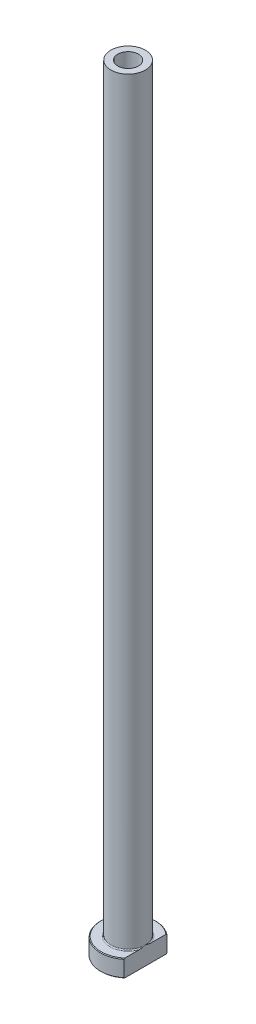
ISO-10303-21;
HEADER;
FILE_DESCRIPTION(('STEP AP214'),'2;1');
FILE_NAME('part.step','',(''),(''),'','','');
FILE_SCHEMA(('AUTOMOTIVE_DESIGN { 1 0 10303 214 1 1 1 1 }'));
ENDSEC;
DATA;
#1=APPLICATION_CONTEXT('core data for automotive mechanical design processes');
#2=APPLICATION_PROTOCOL_DEFINITION('international standard','automotive_design',2000,#1);
#3=PRODUCT_CONTEXT('',#1,'mechanical');
#4=PRODUCT('Part','Part','',(#3));
#5=PRODUCT_RELATED_PRODUCT_CATEGORY('part','',(#4));
#6=PRODUCT_DEFINITION_FORMATION('','',#4);
#7=PRODUCT_DEFINITION_CONTEXT('part definition',#1,'design');
#8=PRODUCT_DEFINITION('design','',#6,#7);
#9=PRODUCT_DEFINITION_SHAPE('','',#8);
#10=(LENGTH_UNIT() NAMED_UNIT(*) SI_UNIT(.MILLI.,.METRE.));
#11=(NAMED_UNIT(*) PLANE_ANGLE_UNIT() SI_UNIT($,.RADIAN.));
#12=(NAMED_UNIT(*) SI_UNIT($,.STERADIAN.) SOLID_ANGLE_UNIT());
#13=UNCERTAINTY_MEASURE_WITH_UNIT(LENGTH_MEASURE(1.E-05),#10,'distance_accuracy_value','');
#14=(GEOMETRIC_REPRESENTATION_CONTEXT(3) GLOBAL_UNCERTAINTY_ASSIGNED_CONTEXT((#13)) GLOBAL_UNIT_ASSIGNED_CONTEXT((#10,
#11,#12)) REPRESENTATION_CONTEXT('',''));
#15=CARTESIAN_POINT('',(0.,0.,0.));
#16=DIRECTION('',(0.,0.,1.));
#17=DIRECTION('',(1.,0.,0.));
#18=AXIS2_PLACEMENT_3D('',#15,#16,#17);
#19=CARTESIAN_POINT('',(0.,92.1876809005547,0.));
#20=DIRECTION('',(0.,1.,0.));
#21=DIRECTION('',(0.,0.,1.));
#22=AXIS2_PLACEMENT_3D('',#19,#20,#21);
#23=CYLINDRICAL_SURFACE('',#22,3.00000000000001);
#24=CARTESIAN_POINT('',(0.,225.,0.));
#25=DIRECTION('',(0.,1.,0.));
#26=DIRECTION('',(0.,0.,1.));
#27=AXIS2_PLACEMENT_3D('',#24,#25,#26);
#28=CIRCLE('',#27,3.00000000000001);
#29=CARTESIAN_POINT('',(0.,225.,3.00000000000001));
#30=VERTEX_POINT('',#29);
#31=EDGE_CURVE('E167',#30,#30,#28,.T.);
#32=ORIENTED_EDGE('',*,*,#31,.T.);
#33=EDGE_LOOP('',(#32));
#34=FACE_BOUND('',#33,.T.);
#35=CARTESIAN_POINT('',(0.,180.,0.));
#36=DIRECTION('',(0.,1.,0.));
#37=DIRECTION('',(0.,0.,1.));
#38=AXIS2_PLACEMENT_3D('',#35,#36,#37);
#39=CIRCLE('',#38,3.00000000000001);
#40=CARTESIAN_POINT('',(0.,180.,3.00000000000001));
#41=VERTEX_POINT('',#40);
#42=EDGE_CURVE('E170',#41,#41,#39,.T.);
#43=ORIENTED_EDGE('',*,*,#42,.F.);
#44=EDGE_LOOP('',(#43));
#45=FACE_BOUND('',#44,.T.);
#46=ADVANCED_FACE('F32',(#34,#45),#23,.F.);
#47=CARTESIAN_POINT('',(-3.00000000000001,225.,0.));
#48=DIRECTION('',(0.,1.,0.));
#49=DIRECTION('',(0.,0.,1.));
#50=AXIS2_PLACEMENT_3D('',#47,#48,#49);
#51=PLANE('',#50);
#52=CARTESIAN_POINT('',(0.,225.,0.));
#53=DIRECTION('',(0.,1.,0.));
#54=DIRECTION('',(0.,0.,1.));
#55=AXIS2_PLACEMENT_3D('',#52,#53,#54);
#56=CIRCLE('',#55,5.00000000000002);
#57=CARTESIAN_POINT('',(0.,225.,5.00000000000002));
#58=VERTEX_POINT('',#57);
#59=EDGE_CURVE('E174',#58,#58,#56,.T.);
#60=ORIENTED_EDGE('',*,*,#59,.T.);
#61=EDGE_LOOP('',(#60));
#62=FACE_BOUND('',#61,.T.);
#63=ORIENTED_EDGE('',*,*,#31,.F.);
#64=EDGE_LOOP('',(#63));
#65=FACE_BOUND('',#64,.T.);
#66=ADVANCED_FACE('F157',(#62,#65),#51,.T.);
#67=CARTESIAN_POINT('',(0.,92.1876809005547,0.));
#68=DIRECTION('',(0.,1.,0.));
#69=DIRECTION('',(0.,0.,1.));
#70=AXIS2_PLACEMENT_3D('',#67,#68,#69);
#71=CYLINDRICAL_SURFACE('',#70,5.);
#72=CARTESIAN_POINT('',(0.,5.3,0.));
#73=DIRECTION('',(0.,1.,0.));
#74=DIRECTION('',(0.,0.,1.));
#75=AXIS2_PLACEMENT_3D('',#72,#73,#74);
#76=CIRCLE('',#75,5.);
#77=CARTESIAN_POINT('',(5.,5.3,0.));
#78=VERTEX_POINT('',#77);
#79=EDGE_CURVE('E180',#78,#78,#76,.T.);
#80=ORIENTED_EDGE('',*,*,#79,.T.);
#81=EDGE_LOOP('',(#80));
#82=FACE_BOUND('',#81,.T.);
#83=ORIENTED_EDGE('',*,*,#59,.F.);
#84=EDGE_LOOP('',(#83));
#85=FACE_BOUND('',#84,.T.);
#86=ADVANCED_FACE('F162',(#82,#85),#71,.T.);
#87=CARTESIAN_POINT('',(-4.99999999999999,5.,0.));
#88=DIRECTION('',(0.,1.,0.));
#89=DIRECTION('',(0.,0.,1.));
#90=AXIS2_PLACEMENT_3D('',#87,#88,#89);
#91=PLANE('',#90);
#92=DIRECTION('',(0.,0.,1.));
#93=VECTOR('',#92,1.);
#94=CARTESIAN_POINT('',(5.,5.,0.));
#95=LINE('',#94,#93);
#96=CARTESIAN_POINT('',(5.,5.,-5.98665181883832));
#97=VERTEX_POINT('',#96);
#98=CARTESIAN_POINT('',(5.,5.,-1.75783958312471));
#99=VERTEX_POINT('',#98);
#100=EDGE_CURVE('E54',#97,#99,#95,.T.);
#101=ORIENTED_EDGE('',*,*,#100,.F.);
#102=CARTESIAN_POINT('',(0.,5.,0.));
#103=DIRECTION('',(0.,1.,0.));
#104=DIRECTION('',(0.,0.,1.));
#105=AXIS2_PLACEMENT_3D('',#102,#103,#104);
#106=CIRCLE('',#105,7.80000000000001);
#107=CARTESIAN_POINT('',(4.99999999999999,5.,5.98665181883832));
#108=VERTEX_POINT('',#107);
#109=EDGE_CURVE('E186',#97,#108,#106,.T.);
#110=ORIENTED_EDGE('',*,*,#109,.T.);
#111=CARTESIAN_POINT('',(5.,5.,1.75783958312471));
#112=VERTEX_POINT('',#111);
#113=EDGE_CURVE('E134',#112,#108,#95,.T.);
#114=ORIENTED_EDGE('',*,*,#113,.F.);
#115=CARTESIAN_POINT('',(0.,5.,0.));
#116=DIRECTION('',(0.,1.,0.));
#117=DIRECTION('',(0.,0.,1.));
#118=AXIS2_PLACEMENT_3D('',#115,#116,#117);
#119=CIRCLE('',#118,5.3);
#120=EDGE_CURVE('E183',#112,#99,#119,.F.);
#121=ORIENTED_EDGE('',*,*,#120,.T.);
#122=EDGE_LOOP('',(#101,#110,#114,#121));
#123=FACE_BOUND('',#122,.T.);
#124=ADVANCED_FACE('F197',(#123),#91,.T.);
#125=CARTESIAN_POINT('',(0.,92.1876809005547,0.));
#126=DIRECTION('',(0.,1.,0.));
#127=DIRECTION('',(0.,0.,1.));
#128=AXIS2_PLACEMENT_3D('',#125,#126,#127);
#129=CYLINDRICAL_SURFACE('',#128,7.99999999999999);
#130=DIRECTION('',(0.,-1.,0.));
#131=VECTOR('',#130,1.);
#132=CARTESIAN_POINT('',(4.99999999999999,225.,6.24499799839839));
#133=LINE('',#132,#131);
#134=CARTESIAN_POINT('',(4.99999999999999,4.80000000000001,6.24499799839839));
#135=VERTEX_POINT('',#134);
#136=CARTESIAN_POINT('',(4.99999999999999,0.199999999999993,6.24499799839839));
#137=VERTEX_POINT('',#136);
#138=EDGE_CURVE('E82',#135,#137,#133,.T.);
#139=ORIENTED_EDGE('',*,*,#138,.F.);
#140=CARTESIAN_POINT('',(0.,4.80000000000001,0.));
#141=DIRECTION('',(0.,1.,0.));
#142=DIRECTION('',(0.,0.,1.));
#143=AXIS2_PLACEMENT_3D('',#140,#141,#142);
#144=CIRCLE('',#143,7.99999999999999);
#145=CARTESIAN_POINT('',(5.,4.80000000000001,-6.24499799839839));
#146=VERTEX_POINT('',#145);
#147=EDGE_CURVE('E95',#135,#146,#144,.F.);
#148=ORIENTED_EDGE('',*,*,#147,.T.);
#149=DIRECTION('',(0.,-1.,0.));
#150=VECTOR('',#149,1.);
#151=CARTESIAN_POINT('',(5.,225.,-6.24499799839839));
#152=LINE('',#151,#150);
#153=CARTESIAN_POINT('',(5.,0.199999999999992,-6.24499799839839));
#154=VERTEX_POINT('',#153);
#155=EDGE_CURVE('E192',#146,#154,#152,.T.);
#156=ORIENTED_EDGE('',*,*,#155,.T.);
#157=CARTESIAN_POINT('',(0.,0.199999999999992,0.));
#158=DIRECTION('',(0.,-1.,0.));
#159=DIRECTION('',(0.,0.,-1.));
#160=AXIS2_PLACEMENT_3D('',#157,#158,#159);
#161=CIRCLE('',#160,7.99999999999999);
#162=EDGE_CURVE('E98',#154,#137,#161,.F.);
#163=ORIENTED_EDGE('',*,*,#162,.T.);
#164=EDGE_LOOP('',(#139,#148,#156,#163));
#165=FACE_BOUND('',#164,.T.);
#166=ADVANCED_FACE('F190',(#165),#129,.T.);
#167=CARTESIAN_POINT('',(-7.99999999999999,0.,0.));
#168=DIRECTION('',(0.,-1.,0.));
#169=DIRECTION('',(0.,0.,-1.));
#170=AXIS2_PLACEMENT_3D('',#167,#168,#169);
#171=PLANE('',#170);
#172=CARTESIAN_POINT('',(0.,0.,0.));
#173=DIRECTION('',(0.,-1.,0.));
#174=DIRECTION('',(0.,0.,-1.));
#175=AXIS2_PLACEMENT_3D('',#172,#173,#174);
#176=CIRCLE('',#175,3.75);
#177=CARTESIAN_POINT('',(0.,0.,-3.75));
#178=VERTEX_POINT('',#177);
#179=EDGE_CURVE('E40',#178,#178,#176,.F.);
#180=ORIENTED_EDGE('',*,*,#179,.T.);
#181=EDGE_LOOP('',(#180));
#182=FACE_BOUND('',#181,.T.);
#183=DIRECTION('',(0.,0.,-1.));
#184=VECTOR('',#183,1.);
#185=CARTESIAN_POINT('',(4.99999999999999,0.,6.24499799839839));
#186=LINE('',#185,#184);
#187=CARTESIAN_POINT('',(4.99999999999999,0.,5.98665181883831));
#188=VERTEX_POINT('',#187);
#189=CARTESIAN_POINT('',(5.,0.,-5.98665181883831));
#190=VERTEX_POINT('',#189);
#191=EDGE_CURVE('E47',#188,#190,#186,.T.);
#192=ORIENTED_EDGE('',*,*,#191,.F.);
#193=CARTESIAN_POINT('',(0.,0.,0.));
#194=DIRECTION('',(0.,-1.,0.));
#195=DIRECTION('',(0.,0.,-1.));
#196=AXIS2_PLACEMENT_3D('',#193,#194,#195);
#197=CIRCLE('',#196,7.8);
#198=EDGE_CURVE('E92',#188,#190,#197,.T.);
#199=ORIENTED_EDGE('',*,*,#198,.T.);
#200=EDGE_LOOP('',(#192,#199));
#201=FACE_BOUND('',#200,.T.);
#202=ADVANCED_FACE('F91',(#182,#201),#171,.T.);
#203=CARTESIAN_POINT('',(0.,92.1876809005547,0.));
#204=DIRECTION('',(0.,1.,0.));
#205=DIRECTION('',(0.,0.,1.));
#206=AXIS2_PLACEMENT_3D('',#203,#204,#205);
#207=CYLINDRICAL_SURFACE('',#206,3.25);
#208=CARTESIAN_POINT('',(0.,0.499999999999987,0.));
#209=DIRECTION('',(0.,-1.,0.));
#210=DIRECTION('',(0.,0.,-1.));
#211=AXIS2_PLACEMENT_3D('',#208,#209,#210);
#212=CIRCLE('',#211,3.25);
#213=CARTESIAN_POINT('',(0.,0.499999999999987,-3.25));
#214=VERTEX_POINT('',#213);
#215=EDGE_CURVE('E11',#214,#214,#212,.T.);
#216=ORIENTED_EDGE('',*,*,#215,.T.);
#217=EDGE_LOOP('',(#216));
#218=FACE_BOUND('',#217,.T.);
#219=CARTESIAN_POINT('',(0.,168.,0.));
#220=DIRECTION('',(0.,1.,0.));
#221=DIRECTION('',(0.,0.,1.));
#222=AXIS2_PLACEMENT_3D('',#219,#220,#221);
#223=CIRCLE('',#222,3.25000000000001);
#224=CARTESIAN_POINT('',(0.,168.,3.25000000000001));
#225=VERTEX_POINT('',#224);
#226=EDGE_CURVE('E172',#225,#225,#223,.T.);
#227=ORIENTED_EDGE('',*,*,#226,.T.);
#228=EDGE_LOOP('',(#227));
#229=FACE_BOUND('',#228,.T.);
#230=ADVANCED_FACE('F215',(#218,#229),#207,.F.);
#231=CARTESIAN_POINT('',(0.,168.,0.));
#232=DIRECTION('',(0.,-1.,0.));
#233=DIRECTION('',(0.,0.,-1.));
#234=AXIS2_PLACEMENT_3D('',#231,#232,#233);
#235=CONICAL_SURFACE('',#234,3.25000000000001,0.0208303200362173);
#236=ORIENTED_EDGE('',*,*,#42,.T.);
#237=EDGE_LOOP('',(#236));
#238=FACE_BOUND('',#237,.T.);
#239=ORIENTED_EDGE('',*,*,#226,.F.);
#240=EDGE_LOOP('',(#239));
#241=FACE_BOUND('',#240,.T.);
#242=ADVANCED_FACE('F111',(#238,#241),#235,.F.);
#243=CARTESIAN_POINT('',(0.,5.3,0.));
#244=DIRECTION('',(0.,1.,0.));
#245=DIRECTION('',(0.,0.,1.));
#246=AXIS2_PLACEMENT_3D('',#243,#244,#245);
#247=TOROIDAL_SURFACE('',#246,5.3,0.3);
#248=ORIENTED_EDGE('',*,*,#120,.F.);
#249=CARTESIAN_POINT('',(5.,5.3,0.));
#250=CARTESIAN_POINT('',(5.,5.30000062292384,-1.314694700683E-10));
#251=CARTESIAN_POINT('',(5.,5.30000124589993,2.52759345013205E-07));
#252=CARTESIAN_POINT('',(5.,5.30000240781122,9.47164604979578E-07));
#253=CARTESIAN_POINT('',(5.,5.30000293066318,1.40594067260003E-06));
#254=CARTESIAN_POINT('',(5.,5.30000402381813,2.50637647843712E-06));
#255=CARTESIAN_POINT('',(5.,5.30000457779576,3.16588958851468E-06));
#256=CARTESIAN_POINT('',(5.,5.30000556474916,4.52860022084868E-06));
#257=CARTESIAN_POINT('',(5.,5.30000600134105,5.22939500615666E-06));
#258=CARTESIAN_POINT('',(5.,5.30000763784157,7.96122073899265E-06));
#259=CARTESIAN_POINT('',(5.,5.30000875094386,1.00477420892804E-05));
#260=CARTESIAN_POINT('',(5.,5.30001056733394,1.41660886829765E-05));
#261=CARTESIAN_POINT('',(5.,5.30001129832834,1.61861795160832E-05));
#262=CARTESIAN_POINT('',(5.,5.30001439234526,2.47865760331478E-05));
#263=CARTESIAN_POINT('',(5.,5.30001672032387,3.13830310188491E-05));
#264=CARTESIAN_POINT('',(5.,5.30002012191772,4.38084251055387E-05));
#265=CARTESIAN_POINT('',(5.,5.30002133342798,4.95992766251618E-05));
#266=CARTESIAN_POINT('',(4.99999999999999,5.30003020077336,9.27862656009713E-05));
#267=CARTESIAN_POINT('',(4.99999999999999,5.30003696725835,0.000130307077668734));
#268=CARTESIAN_POINT('',(5.,5.30006659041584,0.000278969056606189));
#269=CARTESIAN_POINT('',(5.,5.30009481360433,0.000389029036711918));
#270=CARTESIAN_POINT('',(4.99999999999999,5.30020506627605,0.000826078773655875));
#271=CARTESIAN_POINT('',(4.99999999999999,5.30028365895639,0.00115365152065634));
#272=CARTESIAN_POINT('',(5.,5.30059919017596,0.00245925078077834));
#273=CARTESIAN_POINT('',(5.,5.30084048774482,0.00343651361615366));
#274=CARTESIAN_POINT('',(4.99999999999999,5.30184626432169,0.00752058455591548));
#275=CARTESIAN_POINT('',(4.99999999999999,5.30260525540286,0.0106283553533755));
#276=CARTESIAN_POINT('',(5.00000000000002,5.30996461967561,0.0407482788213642));
#277=CARTESIAN_POINT('',(5.,5.31658985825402,0.0677561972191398));
#278=CARTESIAN_POINT('',(4.99999999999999,5.32953319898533,0.120688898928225));
#279=CARTESIAN_POINT('',(4.99999999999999,5.3358528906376,0.146613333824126));
#280=CARTESIAN_POINT('',(5.,5.34926050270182,0.201795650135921));
#281=CARTESIAN_POINT('',(5.,5.35634306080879,0.231054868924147));
#282=CARTESIAN_POINT('',(4.99999999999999,5.37050252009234,0.289917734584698));
#283=CARTESIAN_POINT('',(5.,5.3775784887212,0.319521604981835));
#284=CARTESIAN_POINT('',(5.,5.39452602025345,0.391032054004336));
#285=CARTESIAN_POINT('',(5.,5.40434071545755,0.432952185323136));
#286=CARTESIAN_POINT('',(5.,5.42340141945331,0.515763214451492));
#287=CARTESIAN_POINT('',(5.,5.43265559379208,0.556652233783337));
#288=CARTESIAN_POINT('',(5.,5.4571055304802,0.667075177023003));
#289=CARTESIAN_POINT('',(5.,5.47194176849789,0.736689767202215));
#290=CARTESIAN_POINT('',(5.,5.50018229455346,0.876836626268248));
#291=CARTESIAN_POINT('',(5.,5.51357312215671,0.947371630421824));
#292=CARTESIAN_POINT('',(5.,5.53930921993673,1.09497328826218));
#293=CARTESIAN_POINT('',(5.,5.55146217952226,1.1720743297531));
#294=CARTESIAN_POINT('',(5.,5.5723966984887,1.32672649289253));
#295=CARTESIAN_POINT('',(5.,5.58117877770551,1.40427754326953));
#296=CARTESIAN_POINT('',(5.,5.59499725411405,1.5687382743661));
#297=CARTESIAN_POINT('',(5.,5.59948802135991,1.65570044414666));
#298=CARTESIAN_POINT('',(5.,5.60018885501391,1.78535304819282));
#299=CARTESIAN_POINT('',(5.,5.59945214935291,1.82802575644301));
#300=CARTESIAN_POINT('',(5.,5.5955936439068,1.91325081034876));
#301=CARTESIAN_POINT('',(5.,5.59247319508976,1.95580321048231));
#302=CARTESIAN_POINT('',(5.,5.58383242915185,2.03512365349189));
#303=CARTESIAN_POINT('',(5.,5.57867386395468,2.07192937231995));
#304=CARTESIAN_POINT('',(5.,5.56543793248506,2.14526756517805));
#305=CARTESIAN_POINT('',(5.,5.55734203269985,2.18179676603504));
#306=CARTESIAN_POINT('',(5.,5.5371800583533,2.25427226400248));
#307=CARTESIAN_POINT('',(5.,5.52507057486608,2.29020746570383));
#308=CARTESIAN_POINT('',(5.,5.50270928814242,2.34223029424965));
#309=CARTESIAN_POINT('',(5.,5.49457811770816,2.35922314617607));
#310=CARTESIAN_POINT('',(5.,5.47657809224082,2.39224900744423));
#311=CARTESIAN_POINT('',(5.,5.46671281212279,2.40828390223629));
#312=CARTESIAN_POINT('',(5.,5.4469589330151,2.43579467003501));
#313=CARTESIAN_POINT('',(5.,5.43745879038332,2.44754592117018));
#314=CARTESIAN_POINT('',(5.,5.41677914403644,2.46946476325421));
#315=CARTESIAN_POINT('',(5.,5.40560543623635,2.47963758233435));
#316=CARTESIAN_POINT('',(5.,5.38617750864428,2.49393642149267));
#317=CARTESIAN_POINT('',(5.,5.37851643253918,2.49886271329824));
#318=CARTESIAN_POINT('',(5.,5.36252740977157,2.50749953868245));
#319=CARTESIAN_POINT('',(5.,5.35419984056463,2.51121075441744));
#320=CARTESIAN_POINT('',(5.,5.33690648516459,2.51712941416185));
#321=CARTESIAN_POINT('',(5.,5.32793451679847,2.51931927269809));
#322=CARTESIAN_POINT('',(5.,5.30973576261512,2.52185978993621));
#323=CARTESIAN_POINT('',(5.,5.30050931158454,2.52221275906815));
#324=CARTESIAN_POINT('',(5.,5.28349166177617,2.52112455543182));
#325=CARTESIAN_POINT('',(5.,5.27568322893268,2.51993178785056));
#326=CARTESIAN_POINT('',(5.,5.26036860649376,2.51628294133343));
#327=CARTESIAN_POINT('',(5.,5.25286261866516,2.51382603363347));
#328=CARTESIAN_POINT('',(5.,5.23590266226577,2.50685484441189));
#329=CARTESIAN_POINT('',(5.,5.22661875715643,2.5019298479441));
#330=CARTESIAN_POINT('',(5.,5.20895514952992,2.490665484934));
#331=CARTESIAN_POINT('',(5.,5.20057756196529,2.48432291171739));
#332=CARTESIAN_POINT('',(5.,5.17987008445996,2.46645212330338));
#333=CARTESIAN_POINT('',(5.,5.16824151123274,2.45411867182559));
#334=CARTESIAN_POINT('',(5.,5.1469246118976,2.42790849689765));
#335=CARTESIAN_POINT('',(5.,5.13723987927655,2.41402898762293));
#336=CARTESIAN_POINT('',(5.,5.11080706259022,2.37143175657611));
#337=CARTESIAN_POINT('',(5.,5.0962877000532,2.34134703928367));
#338=CARTESIAN_POINT('',(5.,5.0713034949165,2.27940731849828));
#339=CARTESIAN_POINT('',(5.,5.06087110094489,2.24754035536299));
#340=CARTESIAN_POINT('',(5.,5.038903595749,2.1678724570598));
#341=CARTESIAN_POINT('',(5.,5.02913523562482,2.11959065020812));
#342=CARTESIAN_POINT('',(5.,5.01416953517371,2.02224928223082));
#343=CARTESIAN_POINT('',(5.,5.00898637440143,1.97318778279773));
#344=CARTESIAN_POINT('',(5.,5.0022082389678,1.8763576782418));
#345=CARTESIAN_POINT('',(5.,5.00050709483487,1.82859609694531));
#346=CARTESIAN_POINT('',(5.,4.99969104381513,1.73330165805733));
#347=CARTESIAN_POINT('',(5.,5.00056327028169,1.68576884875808));
#348=CARTESIAN_POINT('',(5.,5.00484296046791,1.57937770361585));
#349=CARTESIAN_POINT('',(5.,5.00880932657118,1.52054285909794));
#350=CARTESIAN_POINT('',(5.,5.01925964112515,1.40312974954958));
#351=CARTESIAN_POINT('',(5.,5.02574264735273,1.34455139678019));
#352=CARTESIAN_POINT('',(5.,5.040900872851,1.22627662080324));
#353=CARTESIAN_POINT('',(5.,5.04962425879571,1.16658647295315));
#354=CARTESIAN_POINT('',(5.,5.06877923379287,1.04732463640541));
#355=CARTESIAN_POINT('',(5.,5.07921523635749,0.987753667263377));
#356=CARTESIAN_POINT('',(5.,5.10551698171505,0.846936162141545));
#357=CARTESIAN_POINT('',(4.99999999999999,5.12196565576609,0.765799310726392));
#358=CARTESIAN_POINT('',(5.,5.15639716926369,0.604819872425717));
#359=CARTESIAN_POINT('',(5.,5.17436050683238,0.524973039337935));
#360=CARTESIAN_POINT('',(4.99999999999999,5.20921667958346,0.374726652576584));
#361=CARTESIAN_POINT('',(4.99999999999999,5.22599388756,0.304300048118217));
#362=CARTESIAN_POINT('',(5.,5.25191105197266,0.196907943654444));
#363=CARTESIAN_POINT('',(5.00000000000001,5.26090146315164,0.159905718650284));
#364=CARTESIAN_POINT('',(4.99999999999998,5.27881854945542,0.0865164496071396));
#365=CARTESIAN_POINT('',(4.99999999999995,5.2877439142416,0.0501291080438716));
#366=CARTESIAN_POINT('',(5.,5.29739627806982,0.0106218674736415));
#367=CARTESIAN_POINT('',(5.,5.29815688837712,0.00750762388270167));
#368=CARTESIAN_POINT('',(4.99999999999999,5.29916304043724,0.00342209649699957));
#369=CARTESIAN_POINT('',(4.99999999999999,5.29940309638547,0.00244985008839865));
#370=CARTESIAN_POINT('',(5.,5.29971711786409,0.00115049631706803));
#371=CARTESIAN_POINT('',(5.,5.29979541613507,0.00082414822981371));
#372=CARTESIAN_POINT('',(4.99999999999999,5.29990531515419,0.000388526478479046));
#373=CARTESIAN_POINT('',(4.99999999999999,5.2999334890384,0.000278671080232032));
#374=CARTESIAN_POINT('',(5.,5.29996306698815,0.00013024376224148));
#375=CARTESIAN_POINT('',(5.,5.29996982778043,9.27511422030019E-05));
#376=CARTESIAN_POINT('',(4.99999999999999,5.29997868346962,4.95929917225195E-05));
#377=CARTESIAN_POINT('',(4.99999999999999,5.29997989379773,4.38036586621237E-05));
#378=CARTESIAN_POINT('',(4.99999999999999,5.29998329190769,3.13814212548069E-05));
#379=CARTESIAN_POINT('',(4.99999999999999,5.29998561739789,2.47865239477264E-05));
#380=CARTESIAN_POINT('',(5.,5.29998870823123,1.61877558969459E-05));
#381=CARTESIAN_POINT('',(5.,5.29998943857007,1.41677782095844E-05));
#382=CARTESIAN_POINT('',(5.,5.29999125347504,1.00495542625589E-05));
#383=CARTESIAN_POINT('',(5.,5.29999236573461,7.96302750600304E-06));
#384=CARTESIAN_POINT('',(5.,5.29999400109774,5.23107472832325E-06));
#385=CARTESIAN_POINT('',(5.,5.29999443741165,4.53021092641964E-06));
#386=CARTESIAN_POINT('',(5.,5.2999954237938,3.16731207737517E-06));
#387=CARTESIAN_POINT('',(5.,5.29999597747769,2.50767769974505E-06));
#388=CARTESIAN_POINT('',(5.,5.29999707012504,1.40695909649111E-06));
#389=CARTESIAN_POINT('',(5.,5.29999759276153,9.48032716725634E-07));
#390=CARTESIAN_POINT('',(5.,5.29999875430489,2.53244456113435E-07));
#391=CARTESIAN_POINT('',(5.,5.29999937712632,1.31460272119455E-10));
#392=CARTESIAN_POINT('',(5.,5.3,0.));
#393=B_SPLINE_CURVE_WITH_KNOTS('',3,(#249,#250,#251,#252,#253,#254,#255,#256,#257,#258,#259,
#260,#261,#262,#263,#264,#265,#266,#267,#268,#269,#270,#271,#272,#273,#274,#275,#276,#277,#278,
#279,#280,#281,#282,#283,#284,#285,#286,#287,#288,#289,#290,#291,#292,#293,#294,#295,#296,#297,
#298,#299,#300,#301,#302,#303,#304,#305,#306,#307,#308,#309,#310,#311,#312,#313,#314,#315,#316,
#317,#318,#319,#320,#321,#322,#323,#324,#325,#326,#327,#328,#329,#330,#331,#332,#333,#334,#335,
#336,#337,#338,#339,#340,#341,#342,#343,#344,#345,#346,#347,#348,#349,#350,#351,#352,#353,#354,
#355,#356,#357,#358,#359,#360,#361,#362,#363,#364,#365,#366,#367,#368,#369,#370,#371,#372,#373,
#374,#375,#376,#377,#378,#379,#380,#381,#382,#383,#384,#385,#386,#387,#388,#389,#390,#391,#392),
.UNSPECIFIED.,.T.,.F.,(4,2,2,2,2,2,2,2,2,2,2,2,2,2,2,2,2,2,2,2,2,2,2,2,2,2,2,2,2,2,2,2,2,2,2,2,
2,2,2,2,2,2,2,2,2,2,2,2,2,2,2,2,2,2,2,2,2,2,2,2,2,2,2,2,2,2,2,2,2,2,2,4),(0.,
1.88939154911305E-06,3.98058628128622E-06,6.54818199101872E-06,9.0240392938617E-06,
1.60938698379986E-05,2.25328132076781E-05,4.34843859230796E-05,6.12120117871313E-05,
0.00017562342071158,0.000516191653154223,0.00152710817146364,0.00454656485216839,
0.0141443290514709,0.0975679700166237,0.177619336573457,0.267931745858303,0.359245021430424,
0.488405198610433,0.614173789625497,0.827694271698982,1.04305715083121,1.2771560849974,
1.51121890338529,1.77214751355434,1.9001350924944,2.02805018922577,2.13945459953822,
2.25157451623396,2.36494894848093,2.42139235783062,2.47772074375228,2.52293802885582,
2.56800219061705,2.59524342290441,2.62246933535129,2.65000494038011,2.67750590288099,
2.70108948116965,2.72468854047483,2.7560397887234,2.78746268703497,2.83802806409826,
2.8886860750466,2.98834295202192,3.0887757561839,3.23618650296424,3.38405153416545,
3.52733651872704,3.66990630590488,3.8467390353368,4.02350562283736,4.2044477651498,
4.38586374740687,4.63419556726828,4.87971270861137,5.09690175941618,5.21113882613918,
5.32353360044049,5.33315137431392,5.3361553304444,5.3371624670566,5.33750240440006,
5.33761672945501,5.337634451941,5.33765539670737,5.33766183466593,5.33766890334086,
5.3376713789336,5.3376739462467,5.33767603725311,5.33767792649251),.UNSPECIFIED.);
#394=EDGE_CURVE('E126',#112,#78,#393,.T.);
#395=ORIENTED_EDGE('',*,*,#394,.T.);
#396=ORIENTED_EDGE('',*,*,#79,.F.);
#397=CARTESIAN_POINT('',(5.,5.3,0.));
#398=CARTESIAN_POINT('',(5.,5.29999937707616,1.31471023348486E-10));
#399=CARTESIAN_POINT('',(5.,5.29999875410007,-2.52759343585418E-07));
#400=CARTESIAN_POINT('',(5.,5.29999759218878,-9.47164603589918E-07));
#401=CARTESIAN_POINT('',(5.,5.29999706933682,-1.40594067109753E-06));
#402=CARTESIAN_POINT('',(5.,5.29999597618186,-2.50637647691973E-06));
#403=CARTESIAN_POINT('',(5.,5.29999542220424,-3.16588958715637E-06));
#404=CARTESIAN_POINT('',(5.,5.29999443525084,-4.52860021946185E-06));
#405=CARTESIAN_POINT('',(5.,5.29999399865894,-5.22939500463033E-06));
#406=CARTESIAN_POINT('',(5.,5.29999236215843,-7.9612207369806E-06));
#407=CARTESIAN_POINT('',(5.,5.29999124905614,-1.00477420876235E-05));
#408=CARTESIAN_POINT('',(5.,5.29998943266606,-1.4166088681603E-05));
#409=CARTESIAN_POINT('',(5.,5.29998870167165,-1.61861795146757E-05));
#410=CARTESIAN_POINT('',(5.,5.29998560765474,-2.47865760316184E-05));
#411=CARTESIAN_POINT('',(5.,5.29998327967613,-3.13830310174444E-05));
#412=CARTESIAN_POINT('',(5.,5.29997987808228,-4.38084251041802E-05));
#413=CARTESIAN_POINT('',(5.,5.29997866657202,-4.9599276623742E-05));
#414=CARTESIAN_POINT('',(4.99999999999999,5.29996979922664,-9.2786265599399E-05));
#415=CARTESIAN_POINT('',(4.99999999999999,5.29996303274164,-0.000130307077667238));
#416=CARTESIAN_POINT('',(5.,5.29993340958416,-0.000278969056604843));
#417=CARTESIAN_POINT('',(5.,5.29990518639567,-0.000389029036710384));
#418=CARTESIAN_POINT('',(4.99999999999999,5.29979493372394,-0.000826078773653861));
#419=CARTESIAN_POINT('',(4.99999999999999,5.2997163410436,-0.00115365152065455));
#420=CARTESIAN_POINT('',(5.,5.29940080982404,-0.00245925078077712));
#421=CARTESIAN_POINT('',(5.,5.29915951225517,-0.00343651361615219));
#422=CARTESIAN_POINT('',(4.99999999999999,5.29815373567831,-0.00752058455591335));
#423=CARTESIAN_POINT('',(4.99999999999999,5.29739474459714,-0.0106283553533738));
#424=CARTESIAN_POINT('',(5.00000000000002,5.2900353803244,-0.0407482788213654));
#425=CARTESIAN_POINT('',(5.,5.28341014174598,-0.0677561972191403));
#426=CARTESIAN_POINT('',(4.99999999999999,5.27046680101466,-0.120688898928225));
#427=CARTESIAN_POINT('',(4.99999999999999,5.2641471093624,-0.146613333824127));
#428=CARTESIAN_POINT('',(5.,5.25073949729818,-0.201795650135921));
#429=CARTESIAN_POINT('',(5.,5.2436569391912,-0.231054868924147));
#430=CARTESIAN_POINT('',(4.99999999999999,5.22949747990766,-0.289917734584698));
#431=CARTESIAN_POINT('',(5.,5.2224215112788,-0.319521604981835));
#432=CARTESIAN_POINT('',(5.,5.20547397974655,-0.391032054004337));
#433=CARTESIAN_POINT('',(5.,5.19565928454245,-0.432952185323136));
#434=CARTESIAN_POINT('',(5.,5.17659858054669,-0.515763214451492));
#435=CARTESIAN_POINT('',(5.,5.16734440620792,-0.556652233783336));
#436=CARTESIAN_POINT('',(5.,5.1428944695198,-0.667075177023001));
#437=CARTESIAN_POINT('',(5.,5.1280582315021,-0.736689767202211));
#438=CARTESIAN_POINT('',(5.,5.09981770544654,-0.876836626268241));
#439=CARTESIAN_POINT('',(5.,5.08642687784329,-0.947371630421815));
#440=CARTESIAN_POINT('',(5.,5.06069078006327,-1.09497328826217));
#441=CARTESIAN_POINT('',(5.,5.04853782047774,-1.17207432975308));
#442=CARTESIAN_POINT('',(5.,5.0276033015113,-1.32672649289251));
#443=CARTESIAN_POINT('',(5.,5.01882122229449,-1.40427754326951));
#444=CARTESIAN_POINT('',(5.,5.00500274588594,-1.56873827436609));
#445=CARTESIAN_POINT('',(5.,5.00051197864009,-1.65570044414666));
#446=CARTESIAN_POINT('',(5.,4.99981114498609,-1.78535304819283));
#447=CARTESIAN_POINT('',(5.,5.00054785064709,-1.82802575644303));
#448=CARTESIAN_POINT('',(5.,5.0044063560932,-1.91325081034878));
#449=CARTESIAN_POINT('',(5.,5.00752680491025,-1.95580321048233));
#450=CARTESIAN_POINT('',(5.,5.01616757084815,-2.03512365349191));
#451=CARTESIAN_POINT('',(5.,5.02132613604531,-2.07192937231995));
#452=CARTESIAN_POINT('',(5.,5.03456206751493,-2.14526756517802));
#453=CARTESIAN_POINT('',(5.,5.04265796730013,-2.181796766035));
#454=CARTESIAN_POINT('',(5.,5.06281994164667,-2.2542722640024));
#455=CARTESIAN_POINT('',(5.,5.07492942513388,-2.29020746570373));
#456=CARTESIAN_POINT('',(5.,5.09729071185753,-2.34223029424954));
#457=CARTESIAN_POINT('',(5.,5.10542188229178,-2.35922314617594));
#458=CARTESIAN_POINT('',(5.,5.1234219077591,-2.39224900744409));
#459=CARTESIAN_POINT('',(5.,5.13328718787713,-2.40828390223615));
#460=CARTESIAN_POINT('',(5.,5.1530410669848,-2.43579467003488));
#461=CARTESIAN_POINT('',(5.,5.16254120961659,-2.44754592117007));
#462=CARTESIAN_POINT('',(5.,5.18322085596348,-2.46946476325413));
#463=CARTESIAN_POINT('',(5.,5.19439456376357,-2.47963758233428));
#464=CARTESIAN_POINT('',(5.,5.21382249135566,-2.49393642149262));
#465=CARTESIAN_POINT('',(5.,5.22148356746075,-2.4988627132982));
#466=CARTESIAN_POINT('',(5.,5.23747259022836,-2.50749953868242));
#467=CARTESIAN_POINT('',(5.,5.2458001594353,-2.51121075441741));
#468=CARTESIAN_POINT('',(5.,5.26309351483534,-2.51712941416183));
#469=CARTESIAN_POINT('',(5.,5.27206548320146,-2.51931927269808));
#470=CARTESIAN_POINT('',(5.,5.29026423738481,-2.52185978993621));
#471=CARTESIAN_POINT('',(5.,5.29949068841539,-2.52221275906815));
#472=CARTESIAN_POINT('',(5.,5.31650833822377,-2.52112455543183));
#473=CARTESIAN_POINT('',(5.,5.32431677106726,-2.51993178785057));
#474=CARTESIAN_POINT('',(5.,5.33963139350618,-2.51628294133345));
#475=CARTESIAN_POINT('',(5.,5.34713738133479,-2.51382603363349));
#476=CARTESIAN_POINT('',(5.,5.36409733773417,-2.50685484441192));
#477=CARTESIAN_POINT('',(5.,5.37338124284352,-2.50192984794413));
#478=CARTESIAN_POINT('',(5.,5.39104485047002,-2.49066548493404));
#479=CARTESIAN_POINT('',(5.,5.39942243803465,-2.48432291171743));
#480=CARTESIAN_POINT('',(5.,5.42012991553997,-2.46645212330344));
#481=CARTESIAN_POINT('',(5.,5.43175848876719,-2.45411867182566));
#482=CARTESIAN_POINT('',(5.,5.45307538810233,-2.42790849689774));
#483=CARTESIAN_POINT('',(5.,5.46276012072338,-2.41402898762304));
#484=CARTESIAN_POINT('',(5.,5.4891929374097,-2.37143175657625));
#485=CARTESIAN_POINT('',(5.,5.50371229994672,-2.34134703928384));
#486=CARTESIAN_POINT('',(5.,5.52869650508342,-2.2794073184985));
#487=CARTESIAN_POINT('',(5.,5.53912889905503,-2.24754035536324));
#488=CARTESIAN_POINT('',(5.,5.56109640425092,-2.16787245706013));
#489=CARTESIAN_POINT('',(5.,5.57086476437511,-2.1195906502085));
#490=CARTESIAN_POINT('',(5.,5.58583046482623,-2.0222492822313));
#491=CARTESIAN_POINT('',(5.,5.59101362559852,-1.97318778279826));
#492=CARTESIAN_POINT('',(5.,5.59779176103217,-1.87635767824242));
#493=CARTESIAN_POINT('',(5.,5.59949290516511,-1.82859609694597));
#494=CARTESIAN_POINT('',(5.,5.60030895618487,-1.73330165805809));
#495=CARTESIAN_POINT('',(5.,5.59943672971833,-1.68576884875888));
#496=CARTESIAN_POINT('',(5.,5.59515703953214,-1.57937770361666));
#497=CARTESIAN_POINT('',(5.,5.59119067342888,-1.52054285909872));
#498=CARTESIAN_POINT('',(5.,5.58074035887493,-1.4031297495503));
#499=CARTESIAN_POINT('',(5.,5.57425735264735,-1.34455139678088));
#500=CARTESIAN_POINT('',(5.,5.55909912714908,-1.22627662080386));
#501=CARTESIAN_POINT('',(5.,5.55037574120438,-1.16658647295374));
#502=CARTESIAN_POINT('',(5.,5.53122076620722,-1.04732463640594));
#503=CARTESIAN_POINT('',(5.,5.5207847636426,-0.987753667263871));
#504=CARTESIAN_POINT('',(5.,5.49448301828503,-0.846936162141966));
#505=CARTESIAN_POINT('',(5.,5.47803434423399,-0.765799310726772));
#506=CARTESIAN_POINT('',(5.,5.44360283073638,-0.604819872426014));
#507=CARTESIAN_POINT('',(5.,5.42563949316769,-0.524973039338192));
#508=CARTESIAN_POINT('',(5.,5.39078332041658,-0.374726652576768));
#509=CARTESIAN_POINT('',(5.,5.37400611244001,-0.304300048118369));
#510=CARTESIAN_POINT('',(5.,5.34808894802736,-0.196907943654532));
#511=CARTESIAN_POINT('',(4.99999999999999,5.33909853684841,-0.159905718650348));
#512=CARTESIAN_POINT('',(5.,5.32118145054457,-0.08651644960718));
#513=CARTESIAN_POINT('',(5.,5.3122560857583,-0.0501291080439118));
#514=CARTESIAN_POINT('',(5.,5.30260372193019,-0.0106218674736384));
#515=CARTESIAN_POINT('',(5.,5.3018431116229,-0.00750762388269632));
#516=CARTESIAN_POINT('',(5.,5.30083695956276,-0.00342209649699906));
#517=CARTESIAN_POINT('',(5.,5.30059690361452,-0.00244985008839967));
#518=CARTESIAN_POINT('',(5.,5.30028288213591,-0.00115049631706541));
#519=CARTESIAN_POINT('',(5.,5.30020458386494,-0.000824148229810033));
#520=CARTESIAN_POINT('',(5.,5.30009468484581,-0.000388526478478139));
#521=CARTESIAN_POINT('',(5.,5.30006651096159,-0.000278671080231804));
#522=CARTESIAN_POINT('',(5.,5.30003693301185,-0.000130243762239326));
#523=CARTESIAN_POINT('',(5.,5.30003017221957,-9.27511422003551E-05));
#524=CARTESIAN_POINT('',(5.,5.30002131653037,-4.95929917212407E-05));
#525=CARTESIAN_POINT('',(5.,5.30002010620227,-4.38036586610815E-05));
#526=CARTESIAN_POINT('',(5.,5.3000167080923,-3.13814212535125E-05));
#527=CARTESIAN_POINT('',(5.,5.30001438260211,-2.47865239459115E-05));
#528=CARTESIAN_POINT('',(5.,5.30001129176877,-1.61877558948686E-05));
#529=CARTESIAN_POINT('',(5.,5.30001056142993,-1.41677782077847E-05));
#530=CARTESIAN_POINT('',(5.,5.30000874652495,-1.00495542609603E-05));
#531=CARTESIAN_POINT('',(5.,5.30000763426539,-7.96302750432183E-06));
#532=CARTESIAN_POINT('',(5.,5.30000599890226,-5.23107472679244E-06));
#533=CARTESIAN_POINT('',(5.,5.30000556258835,-4.53021092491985E-06));
#534=CARTESIAN_POINT('',(5.,5.3000045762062,-3.16731207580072E-06));
#535=CARTESIAN_POINT('',(5.,5.30000402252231,-2.50767769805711E-06));
#536=CARTESIAN_POINT('',(5.,5.30000292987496,-1.4069590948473E-06));
#537=CARTESIAN_POINT('',(5.,5.30000240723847,-9.48032715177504E-07));
#538=CARTESIAN_POINT('',(5.,5.3000012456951,-2.53244454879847E-07));
#539=CARTESIAN_POINT('',(5.,5.30000062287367,-1.31459047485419E-10));
#540=CARTESIAN_POINT('',(5.,5.3,0.));
#541=B_SPLINE_CURVE_WITH_KNOTS('',3,(#397,#398,#399,#400,#401,#402,#403,#404,#405,#406,#407,
#408,#409,#410,#411,#412,#413,#414,#415,#416,#417,#418,#419,#420,#421,#422,#423,#424,#425,#426,
#427,#428,#429,#430,#431,#432,#433,#434,#435,#436,#437,#438,#439,#440,#441,#442,#443,#444,#445,
#446,#447,#448,#449,#450,#451,#452,#453,#454,#455,#456,#457,#458,#459,#460,#461,#462,#463,#464,
#465,#466,#467,#468,#469,#470,#471,#472,#473,#474,#475,#476,#477,#478,#479,#480,#481,#482,#483,
#484,#485,#486,#487,#488,#489,#490,#491,#492,#493,#494,#495,#496,#497,#498,#499,#500,#501,#502,
#503,#504,#505,#506,#507,#508,#509,#510,#511,#512,#513,#514,#515,#516,#517,#518,#519,#520,#521,
#522,#523,#524,#525,#526,#527,#528,#529,#530,#531,#532,#533,#534,#535,#536,#537,#538,#539,#540),
.UNSPECIFIED.,.T.,.F.,(4,2,2,2,2,2,2,2,2,2,2,2,2,2,2,2,2,2,2,2,2,2,2,2,2,2,2,2,2,2,2,2,2,2,2,2,
2,2,2,2,2,2,2,2,2,2,2,2,2,2,2,2,2,2,2,2,2,2,2,2,2,2,2,2,2,2,2,2,2,2,2,4),(0.,
1.88939154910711E-06,3.98058628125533E-06,6.54818199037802E-06,9.02403929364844E-06,
1.60938698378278E-05,2.25328132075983E-05,4.34843859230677E-05,6.12120117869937E-05,
0.000175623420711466,0.000516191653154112,0.00152710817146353,0.00454656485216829,
0.014144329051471,0.0975679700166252,0.177619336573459,0.267931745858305,0.359245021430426,
0.488405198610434,0.614173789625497,0.827694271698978,1.0430571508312,1.27715608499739,
1.51121890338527,1.77214751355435,1.90013509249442,2.0280501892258,2.13945459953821,
2.2515745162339,2.36494894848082,2.42139235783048,2.47772074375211,2.52293802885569,
2.56800219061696,2.59524342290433,2.62246933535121,2.65000494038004,2.67750590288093,
2.70108948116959,2.72468854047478,2.75603978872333,2.7874626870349,2.83802806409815,
2.88868607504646,2.98834295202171,3.08877575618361,3.23618650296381,3.38405153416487,
3.52733651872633,3.66990630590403,3.84673903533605,4.02350562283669,4.20444776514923,
4.3858637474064,4.63419556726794,4.87971270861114,5.09690175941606,5.21113882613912,
5.32353360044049,5.33315137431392,5.3361553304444,5.3371624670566,5.33750240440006,
5.33761672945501,5.337634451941,5.33765539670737,5.33766183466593,5.33766890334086,
5.3376713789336,5.3376739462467,5.33767603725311,5.33767792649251),.UNSPECIFIED.);
#542=EDGE_CURVE('E135',#78,#99,#541,.T.);
#543=ORIENTED_EDGE('',*,*,#542,.T.);
#544=EDGE_LOOP('',(#248,#395,#396,#543));
#545=FACE_BOUND('',#544,.T.);
#546=ADVANCED_FACE('F141',(#545),#247,.F.);
#547=CARTESIAN_POINT('',(0.,5.,0.));
#548=DIRECTION('',(0.,-1.,0.));
#549=DIRECTION('',(0.,0.,-1.));
#550=AXIS2_PLACEMENT_3D('',#547,#548,#549);
#551=CONICAL_SURFACE('',#550,7.8,0.78539816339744);
#552=CARTESIAN_POINT('',(5.,-1.82162423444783,-13.7401563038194));
#553=CARTESIAN_POINT('',(5.,-1.61889813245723,-13.5244204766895));
#554=CARTESIAN_POINT('',(5.,-1.41646387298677,-13.3084101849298));
#555=CARTESIAN_POINT('',(5.,-1.01227657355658,-12.8757508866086));
#556=CARTESIAN_POINT('',(5.,-0.81052353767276,-12.6591018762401));
#557=CARTESIAN_POINT('',(5.,-0.206157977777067,-12.0077661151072));
#558=CARTESIAN_POINT('',(5.,0.195280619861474,-11.5719884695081));
#559=CARTESIAN_POINT('',(5.,1.00388282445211,-10.6856136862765));
#560=CARTESIAN_POINT('',(5.,1.41093902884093,-10.2349182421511));
#561=CARTESIAN_POINT('',(5.,2.01658324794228,-9.55471676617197));
#562=CARTESIAN_POINT('',(5.,2.21758236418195,-9.32735800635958));
#563=CARTESIAN_POINT('',(5.,2.61761142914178,-8.87091599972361));
#564=CARTESIAN_POINT('',(5.,2.81664139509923,-8.64183276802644));
#565=CARTESIAN_POINT('',(5.,3.21217345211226,-8.18170099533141));
#566=CARTESIAN_POINT('',(5.,3.40867681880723,-7.95065355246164));
#567=CARTESIAN_POINT('',(5.,3.79865427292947,-7.4859998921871));
#568=CARTESIAN_POINT('',(5.,3.99212827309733,-7.25239360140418));
#569=CARTESIAN_POINT('',(5.,4.37558160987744,-6.78155890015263));
#570=CARTESIAN_POINT('',(5.,4.56555334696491,-6.54432428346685));
#571=CARTESIAN_POINT('',(5.,4.94042138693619,-6.06589574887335));
#572=CARTESIAN_POINT('',(5.,5.12531810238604,-5.82470215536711));
#573=CARTESIAN_POINT('',(5.,5.48653546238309,-5.33972956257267));
#574=CARTESIAN_POINT('',(5.,5.6629239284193,-5.09600137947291));
#575=CARTESIAN_POINT('',(5.,6.00675382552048,-4.60213647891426));
#576=CARTESIAN_POINT('',(5.,6.17419169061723,-4.35199726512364));
#577=CARTESIAN_POINT('',(5.,6.49592993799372,-3.84445040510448));
#578=CARTESIAN_POINT('',(5.,6.65027272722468,-3.58707012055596));
#579=CARTESIAN_POINT('',(5.,6.86813414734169,-3.19356592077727));
#580=CARTESIAN_POINT('',(5.,6.93845533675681,-3.06120993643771));
#581=CARTESIAN_POINT('',(5.,7.07360441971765,-2.79373319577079));
#582=CARTESIAN_POINT('',(5.,7.13843319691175,-2.65861288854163));
#583=CARTESIAN_POINT('',(5.,7.26869642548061,-2.3693638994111));
#584=CARTESIAN_POINT('',(5.,7.33331212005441,-2.21486278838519));
#585=CARTESIAN_POINT('',(5.,7.45243473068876,-1.9019407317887));
#586=CARTESIAN_POINT('',(5.,7.50694001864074,-1.74351915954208));
#587=CARTESIAN_POINT('',(5.,7.60343746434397,-1.42384276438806));
#588=CARTESIAN_POINT('',(5.,7.64549910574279,-1.26260921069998));
#589=CARTESIAN_POINT('',(5.,7.71543089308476,-0.937062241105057));
#590=CARTESIAN_POINT('',(5.,7.74330266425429,-0.772749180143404));
#591=CARTESIAN_POINT('',(5.,7.78344284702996,-0.439876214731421));
#592=CARTESIAN_POINT('',(5.,7.79548961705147,-0.271289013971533));
#593=CARTESIAN_POINT('',(5.,7.80240809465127,0.066227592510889));
#594=CARTESIAN_POINT('',(5.,7.79728142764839,0.235156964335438));
#595=CARTESIAN_POINT('',(5.,7.77017954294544,0.572209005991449));
#596=CARTESIAN_POINT('',(5.,7.74814735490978,0.740327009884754));
#597=CARTESIAN_POINT('',(5.,7.68863212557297,1.0737984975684));
#598=CARTESIAN_POINT('',(5.,7.65114437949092,1.23915112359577));
#599=CARTESIAN_POINT('',(5.,7.54734433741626,1.62344926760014));
#600=CARTESIAN_POINT('',(5.,7.47553580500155,1.84089917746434));
#601=CARTESIAN_POINT('',(5.,7.31300119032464,2.26856946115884));
#602=CARTESIAN_POINT('',(5.,7.22226460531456,2.47878574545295));
#603=CARTESIAN_POINT('',(5.,7.07492970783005,2.7901406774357));
#604=CARTESIAN_POINT('',(5.,7.02362278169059,2.89384077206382));
#605=CARTESIAN_POINT('',(5.,6.91783840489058,3.09961626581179));
#606=CARTESIAN_POINT('',(4.99999999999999,6.86336091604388,3.20169164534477));
#607=CARTESIAN_POINT('',(4.99999999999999,6.75169048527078,3.40428995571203));
#608=CARTESIAN_POINT('',(4.99999999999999,6.69449856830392,3.50481345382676));
#609=CARTESIAN_POINT('',(4.99999999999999,6.57774196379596,3.70446206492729));
#610=CARTESIAN_POINT('',(4.99999999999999,6.51817739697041,3.80358724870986));
#611=CARTESIAN_POINT('',(4.99999999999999,6.30853654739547,4.14435766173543));
#612=CARTESIAN_POINT('',(4.99999999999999,6.15326588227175,4.38281352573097));
#613=CARTESIAN_POINT('',(4.99999999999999,5.83377190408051,4.85367607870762));
#614=CARTESIAN_POINT('',(4.99999999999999,5.66954595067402,5.08608095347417));
#615=CARTESIAN_POINT('',(4.99999999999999,5.33431698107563,5.54628554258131));
#616=CARTESIAN_POINT('',(4.99999999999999,5.16330740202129,5.77408045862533));
#617=CARTESIAN_POINT('',(4.99999999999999,4.81629923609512,6.22578157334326));
#618=CARTESIAN_POINT('',(4.99999999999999,4.64030119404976,6.44968819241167));
#619=CARTESIAN_POINT('',(4.99999999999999,4.28368615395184,6.8953257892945));
#620=CARTESIAN_POINT('',(4.99999999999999,4.10305289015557,7.11704371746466));
#621=CARTESIAN_POINT('',(4.99999999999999,3.73870710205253,7.55793799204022));
#622=CARTESIAN_POINT('',(4.99999999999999,3.5549945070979,7.77711427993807));
#623=CARTESIAN_POINT('',(4.99999999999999,3.1852108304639,8.21325328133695));
#624=CARTESIAN_POINT('',(4.99999999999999,2.99914113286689,8.43021717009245));
#625=CARTESIAN_POINT('',(4.99999999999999,2.62499812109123,8.86241167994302));
#626=CARTESIAN_POINT('',(4.99999999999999,2.43692478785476,9.0776422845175));
#627=CARTESIAN_POINT('',(4.99999999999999,1.9146340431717,9.67075518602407));
#628=CARTESIAN_POINT('',(4.99999999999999,1.57868086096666,10.0471086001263));
#629=CARTESIAN_POINT('',(4.99999999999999,0.903003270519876,10.7965122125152));
#630=CARTESIAN_POINT('',(4.99999999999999,0.563278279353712,11.169561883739));
#631=CARTESIAN_POINT('',(4.99999999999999,-0.116149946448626,11.9100168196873));
#632=CARTESIAN_POINT('',(4.99999999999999,-0.455830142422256,12.2774432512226));
#633=CARTESIAN_POINT('',(4.99999999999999,-1.13728640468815,13.0102135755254));
#634=CARTESIAN_POINT('',(4.99999999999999,-1.47906204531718,13.3755578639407));
#635=CARTESIAN_POINT('',(4.99999999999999,-1.82162423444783,13.7401563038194));
#636=B_SPLINE_CURVE_WITH_KNOTS('',3,(#552,#553,#554,#555,#556,#557,#558,#559,#560,#561,#562,
#563,#564,#565,#566,#567,#568,#569,#570,#571,#572,#573,#574,#575,#576,#577,#578,#579,#580,#581,
#582,#583,#584,#585,#586,#587,#588,#589,#590,#591,#592,#593,#594,#595,#596,#597,#598,#599,#600,
#601,#602,#603,#604,#605,#606,#607,#608,#609,#610,#611,#612,#613,#614,#615,#616,#617,#618,#619,
#620,#621,#622,#623,#624,#625,#626,#627,#628,#629,#630,#631,#632,#633,#634,#635),.UNSPECIFIED.,
.F.,.F.,(4,2,2,2,2,2,2,2,2,2,2,2,2,2,2,2,2,2,2,2,2,2,2,2,2,2,2,2,2,2,2,2,2,2,2,2,2,2,2,2,2,4),
(0.,0.888120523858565,1.77624635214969,3.55372511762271,5.3755948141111,6.28598924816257,
7.19637570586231,8.10628289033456,9.01621623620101,9.92793449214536,10.8395784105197,
11.7420025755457,12.6447836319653,13.5445196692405,13.9940505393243,14.4435089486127,
14.9456212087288,15.4478142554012,15.9471477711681,16.4464240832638,16.952621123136,
17.458770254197,17.966632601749,18.4746496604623,19.160451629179,19.8466351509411,
20.193687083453,20.5407431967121,20.8876692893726,21.2345777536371,22.087909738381,
22.9414946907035,23.7959266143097,24.6502655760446,25.5081848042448,26.3661237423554,
27.2235803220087,28.0810450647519,29.5944656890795,31.1081235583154,32.60926785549,
34.1101167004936),.UNSPECIFIED.);
#637=EDGE_CURVE('E133',#146,#97,#636,.T.);
#638=ORIENTED_EDGE('',*,*,#637,.F.);
#639=ORIENTED_EDGE('',*,*,#147,.F.);
#640=EDGE_CURVE('E118',#108,#135,#636,.T.);
#641=ORIENTED_EDGE('',*,*,#640,.F.);
#642=ORIENTED_EDGE('',*,*,#109,.F.);
#643=EDGE_LOOP('',(#638,#639,#641,#642));
#644=FACE_BOUND('',#643,.T.);
#645=ADVANCED_FACE('F145',(#644),#551,.T.);
#646=CARTESIAN_POINT('',(0.,0.199999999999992,0.));
#647=DIRECTION('',(0.,1.,0.));
#648=DIRECTION('',(0.,0.,1.));
#649=AXIS2_PLACEMENT_3D('',#646,#647,#648);
#650=CONICAL_SURFACE('',#649,7.99999999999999,0.78539816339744);
#651=CARTESIAN_POINT('',(4.99999999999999,6.82162423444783,13.7401563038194));
#652=CARTESIAN_POINT('',(4.99999999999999,6.61889813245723,13.5244204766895));
#653=CARTESIAN_POINT('',(4.99999999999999,6.41646387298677,13.3084101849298));
#654=CARTESIAN_POINT('',(4.99999999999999,6.01227657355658,12.8757508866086));
#655=CARTESIAN_POINT('',(4.99999999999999,5.81052353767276,12.6591018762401));
#656=CARTESIAN_POINT('',(4.99999999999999,5.20615797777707,12.0077661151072));
#657=CARTESIAN_POINT('',(4.99999999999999,4.80471938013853,11.5719884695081));
#658=CARTESIAN_POINT('',(4.99999999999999,3.99611717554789,10.6856136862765));
#659=CARTESIAN_POINT('',(4.99999999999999,3.58906097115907,10.2349182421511));
#660=CARTESIAN_POINT('',(4.99999999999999,2.98341675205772,9.55471676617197));
#661=CARTESIAN_POINT('',(4.99999999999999,2.78241763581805,9.32735800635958));
#662=CARTESIAN_POINT('',(4.99999999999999,2.38238857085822,8.87091599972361));
#663=CARTESIAN_POINT('',(4.99999999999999,2.18335860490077,8.64183276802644));
#664=CARTESIAN_POINT('',(4.99999999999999,1.78782654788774,8.18170099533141));
#665=CARTESIAN_POINT('',(4.99999999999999,1.59132318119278,7.95065355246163));
#666=CARTESIAN_POINT('',(4.99999999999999,1.20134572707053,7.4859998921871));
#667=CARTESIAN_POINT('',(4.99999999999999,1.00787172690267,7.25239360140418));
#668=CARTESIAN_POINT('',(4.99999999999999,0.624418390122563,6.78155890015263));
#669=CARTESIAN_POINT('',(4.99999999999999,0.434446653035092,6.54432428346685));
#670=CARTESIAN_POINT('',(4.99999999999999,0.0595786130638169,6.06589574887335));
#671=CARTESIAN_POINT('',(4.99999999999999,-0.125318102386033,5.82470215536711));
#672=CARTESIAN_POINT('',(4.99999999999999,-0.486535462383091,5.33972956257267));
#673=CARTESIAN_POINT('',(4.99999999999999,-0.662923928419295,5.09600137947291));
#674=CARTESIAN_POINT('',(4.99999999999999,-1.00675382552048,4.60213647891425));
#675=CARTESIAN_POINT('',(4.99999999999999,-1.17419169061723,4.35199726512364));
#676=CARTESIAN_POINT('',(4.99999999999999,-1.49592993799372,3.84445040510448));
#677=CARTESIAN_POINT('',(4.99999999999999,-1.65027272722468,3.58707012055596));
#678=CARTESIAN_POINT('',(4.99999999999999,-1.86813414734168,3.19356592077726));
#679=CARTESIAN_POINT('',(5.,-1.93845533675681,3.06120993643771));
#680=CARTESIAN_POINT('',(5.,-2.07360441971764,2.79373319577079));
#681=CARTESIAN_POINT('',(5.,-2.13843319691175,2.65861288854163));
#682=CARTESIAN_POINT('',(5.,-2.26869642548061,2.3693638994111));
#683=CARTESIAN_POINT('',(5.,-2.33331212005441,2.21486278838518));
#684=CARTESIAN_POINT('',(5.,-2.45243473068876,1.9019407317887));
#685=CARTESIAN_POINT('',(5.,-2.50694001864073,1.74351915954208));
#686=CARTESIAN_POINT('',(5.,-2.60343746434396,1.42384276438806));
#687=CARTESIAN_POINT('',(5.,-2.64549910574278,1.26260921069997));
#688=CARTESIAN_POINT('',(5.,-2.71543089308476,0.937062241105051));
#689=CARTESIAN_POINT('',(5.,-2.74330266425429,0.772749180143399));
#690=CARTESIAN_POINT('',(5.,-2.78344284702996,0.439876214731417));
#691=CARTESIAN_POINT('',(5.,-2.79548961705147,0.271289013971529));
#692=CARTESIAN_POINT('',(5.,-2.80240809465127,-0.0662275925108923));
#693=CARTESIAN_POINT('',(5.,-2.79728142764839,-0.23515696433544));
#694=CARTESIAN_POINT('',(5.,-2.77017954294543,-0.57220900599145));
#695=CARTESIAN_POINT('',(5.,-2.74814735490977,-0.740327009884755));
#696=CARTESIAN_POINT('',(5.,-2.68863212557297,-1.0737984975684));
#697=CARTESIAN_POINT('',(5.,-2.65114437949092,-1.23915112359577));
#698=CARTESIAN_POINT('',(5.,-2.54734433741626,-1.62344926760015));
#699=CARTESIAN_POINT('',(5.,-2.47553580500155,-1.84089917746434));
#700=CARTESIAN_POINT('',(5.,-2.31300119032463,-2.26856946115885));
#701=CARTESIAN_POINT('',(5.,-2.22226460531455,-2.47878574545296));
#702=CARTESIAN_POINT('',(5.,-2.07492970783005,-2.7901406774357));
#703=CARTESIAN_POINT('',(5.,-2.02362278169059,-2.89384077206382));
#704=CARTESIAN_POINT('',(5.,-1.91783840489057,-3.0996162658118));
#705=CARTESIAN_POINT('',(5.,-1.86336091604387,-3.20169164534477));
#706=CARTESIAN_POINT('',(5.,-1.75169048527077,-3.40428995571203));
#707=CARTESIAN_POINT('',(5.,-1.69449856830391,-3.50481345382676));
#708=CARTESIAN_POINT('',(5.,-1.57774196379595,-3.70446206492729));
#709=CARTESIAN_POINT('',(5.,-1.5181773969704,-3.80358724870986));
#710=CARTESIAN_POINT('',(5.,-1.30853654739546,-4.14435766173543));
#711=CARTESIAN_POINT('',(5.,-1.15326588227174,-4.38281352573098));
#712=CARTESIAN_POINT('',(5.,-0.833771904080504,-4.85367607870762));
#713=CARTESIAN_POINT('',(5.,-0.669545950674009,-5.08608095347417));
#714=CARTESIAN_POINT('',(5.,-0.334316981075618,-5.54628554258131));
#715=CARTESIAN_POINT('',(5.,-0.163307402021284,-5.77408045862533));
#716=CARTESIAN_POINT('',(5.,0.183700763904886,-6.22578157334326));
#717=CARTESIAN_POINT('',(5.,0.35969880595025,-6.44968819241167));
#718=CARTESIAN_POINT('',(5.,0.716313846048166,-6.8953257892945));
#719=CARTESIAN_POINT('',(5.,0.896947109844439,-7.11704371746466));
#720=CARTESIAN_POINT('',(5.,1.26129289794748,-7.55793799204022));
#721=CARTESIAN_POINT('',(5.,1.4450054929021,-7.77711427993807));
#722=CARTESIAN_POINT('',(5.,1.8147891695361,-8.21325328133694));
#723=CARTESIAN_POINT('',(5.,2.00085886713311,-8.43021717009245));
#724=CARTESIAN_POINT('',(5.,2.37500187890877,-8.86241167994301));
#725=CARTESIAN_POINT('',(5.,2.56307521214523,-9.07764228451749));
#726=CARTESIAN_POINT('',(5.,3.08536595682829,-9.67075518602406));
#727=CARTESIAN_POINT('',(5.,3.42131913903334,-10.0471086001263));
#728=CARTESIAN_POINT('',(5.,4.09699672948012,-10.7965122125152));
#729=CARTESIAN_POINT('',(5.,4.43672172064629,-11.169561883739));
#730=CARTESIAN_POINT('',(5.,5.11614994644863,-11.9100168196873));
#731=CARTESIAN_POINT('',(5.,5.45583014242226,-12.2774432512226));
#732=CARTESIAN_POINT('',(5.,6.13728640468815,-13.0102135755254));
#733=CARTESIAN_POINT('',(5.,6.47906204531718,-13.3755578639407));
#734=CARTESIAN_POINT('',(5.,6.82162423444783,-13.7401563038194));
#735=B_SPLINE_CURVE_WITH_KNOTS('',3,(#651,#652,#653,#654,#655,#656,#657,#658,#659,#660,#661,
#662,#663,#664,#665,#666,#667,#668,#669,#670,#671,#672,#673,#674,#675,#676,#677,#678,#679,#680,
#681,#682,#683,#684,#685,#686,#687,#688,#689,#690,#691,#692,#693,#694,#695,#696,#697,#698,#699,
#700,#701,#702,#703,#704,#705,#706,#707,#708,#709,#710,#711,#712,#713,#714,#715,#716,#717,#718,
#719,#720,#721,#722,#723,#724,#725,#726,#727,#728,#729,#730,#731,#732,#733,#734),.UNSPECIFIED.,
.F.,.F.,(4,2,2,2,2,2,2,2,2,2,2,2,2,2,2,2,2,2,2,2,2,2,2,2,2,2,2,2,2,2,2,2,2,2,2,2,2,2,2,2,2,4),
(0.,0.888120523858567,1.77624635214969,3.55372511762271,5.37559481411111,6.28598924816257,
7.19637570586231,8.10628289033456,9.01621623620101,9.92793449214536,10.8395784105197,
11.7420025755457,12.6447836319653,13.5445196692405,13.9940505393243,14.4435089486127,
14.9456212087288,15.4478142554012,15.9471477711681,16.4464240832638,16.952621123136,
17.458770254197,17.966632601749,18.4746496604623,19.160451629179,19.8466351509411,
20.193687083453,20.5407431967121,20.8876692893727,21.2345777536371,22.087909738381,
22.9414946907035,23.7959266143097,24.6502655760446,25.5081848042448,26.3661237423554,
27.2235803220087,28.0810450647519,29.5944656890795,31.1081235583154,32.60926785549,
34.1101167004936),.UNSPECIFIED.);
#736=EDGE_CURVE('E79',#137,#188,#735,.T.);
#737=ORIENTED_EDGE('',*,*,#736,.F.);
#738=ORIENTED_EDGE('',*,*,#162,.F.);
#739=EDGE_CURVE('E87',#190,#154,#735,.T.);
#740=ORIENTED_EDGE('',*,*,#739,.F.);
#741=ORIENTED_EDGE('',*,*,#198,.F.);
#742=EDGE_LOOP('',(#737,#738,#740,#741));
#743=FACE_BOUND('',#742,.T.);
#744=ADVANCED_FACE('F94',(#743),#650,.T.);
#745=CARTESIAN_POINT('',(4.99999999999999,225.,6.24499799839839));
#746=DIRECTION('',(-1.,0.,0.));
#747=DIRECTION('',(0.,0.,1.));
#748=AXIS2_PLACEMENT_3D('',#745,#746,#747);
#749=PLANE('',#748);
#750=ORIENTED_EDGE('',*,*,#394,.F.);
#751=ORIENTED_EDGE('',*,*,#113,.T.);
#752=ORIENTED_EDGE('',*,*,#640,.T.);
#753=ORIENTED_EDGE('',*,*,#138,.T.);
#754=ORIENTED_EDGE('',*,*,#736,.T.);
#755=ORIENTED_EDGE('',*,*,#191,.T.);
#756=ORIENTED_EDGE('',*,*,#739,.T.);
#757=ORIENTED_EDGE('',*,*,#155,.F.);
#758=ORIENTED_EDGE('',*,*,#637,.T.);
#759=ORIENTED_EDGE('',*,*,#100,.T.);
#760=ORIENTED_EDGE('',*,*,#542,.F.);
#761=EDGE_LOOP('',(#750,#751,#752,#753,#754,#755,#756,#757,#758,#759,#760));
#762=FACE_BOUND('',#761,.T.);
#763=ADVANCED_FACE('F80',(#762),#749,.F.);
#764=CARTESIAN_POINT('',(0.,0.,0.));
#765=DIRECTION('',(0.,-1.,0.));
#766=DIRECTION('',(0.,0.,-1.));
#767=AXIS2_PLACEMENT_3D('',#764,#765,#766);
#768=CONICAL_SURFACE('',#767,3.75,0.785398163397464);
#769=ORIENTED_EDGE('',*,*,#215,.F.);
#770=EDGE_LOOP('',(#769));
#771=FACE_BOUND('',#770,.T.);
#772=ORIENTED_EDGE('',*,*,#179,.F.);
#773=EDGE_LOOP('',(#772));
#774=FACE_BOUND('',#773,.T.);
#775=ADVANCED_FACE('F34',(#771,#774),#768,.F.);
#776=CLOSED_SHELL('',(#46,#66,#86,#124,#166,#202,#230,#242,#546,#645,#744,#763,#775));
#777=MANIFOLD_SOLID_BREP('B2',#776);
#778=ADVANCED_BREP_SHAPE_REPRESENTATION('',(#18,#777),#14);
#779=SHAPE_DEFINITION_REPRESENTATION(#9,#778);
ENDSEC;
END-ISO-10303-21;
